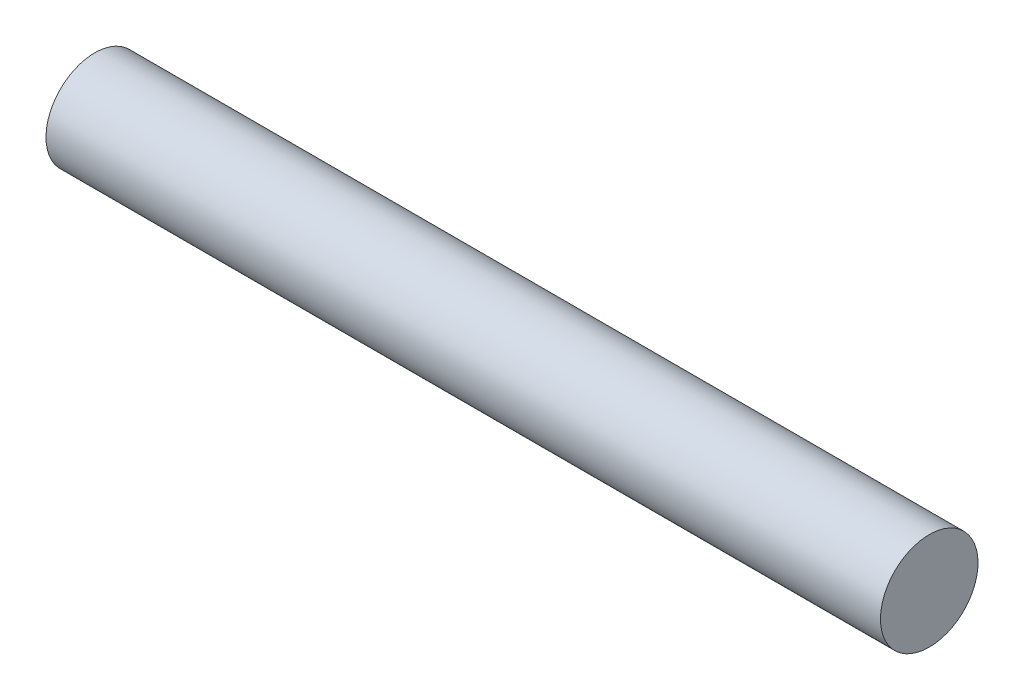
from build123d import *

# Parameters (mm, degrees)
SKETCH1_W = 57.785
SKETCH1_H = 3.3782


with BuildPart() as part:
    # Sketch1 → Revolve1 (revolve)
    with BuildSketch(Plane.XY, mode=Mode.PRIVATE) as revolve1_sk:
        with Locations((28.8925, 1.6891)):
            Rectangle(SKETCH1_W, SKETCH1_H)
    revolve(revolve1_sk.sketch.rotate(Axis((57.785, 0, 0), (-1, 0, 0)), 180), axis=Axis((57.785, 0, 0), (-1, 0, 0)))


solid = part.part
